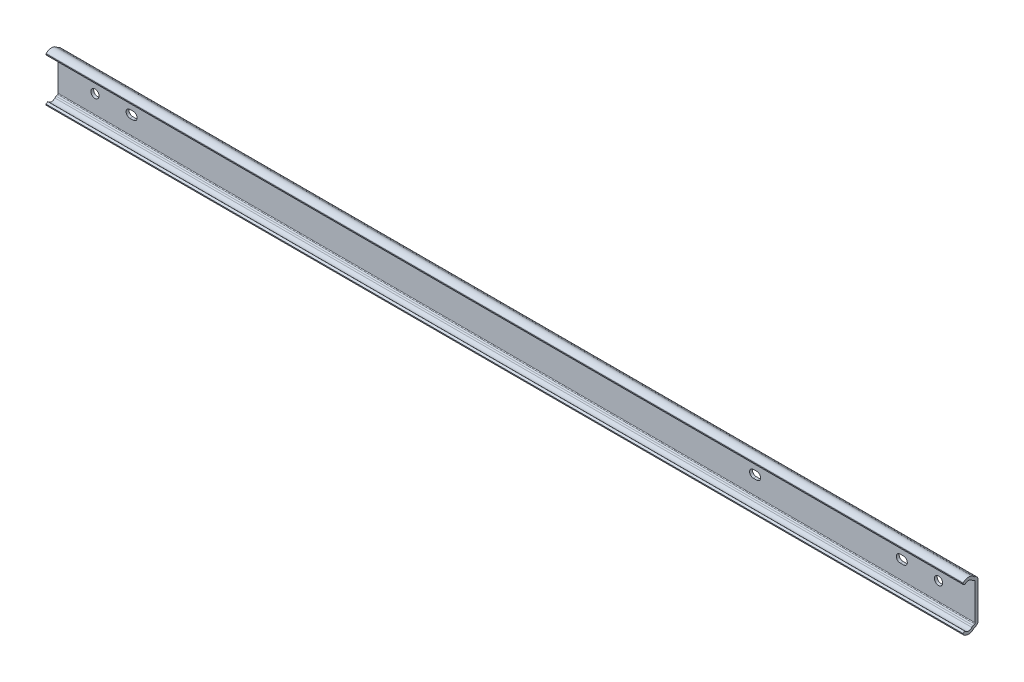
ISO-10303-21;
HEADER;
FILE_DESCRIPTION(('STEP AP214'),'2;1');
FILE_NAME('part.step','',(''),(''),'','','');
FILE_SCHEMA(('AUTOMOTIVE_DESIGN { 1 0 10303 214 1 1 1 1 }'));
ENDSEC;
DATA;
#1=APPLICATION_CONTEXT('core data for automotive mechanical design processes');
#2=APPLICATION_PROTOCOL_DEFINITION('international standard','automotive_design',2000,#1);
#3=PRODUCT_CONTEXT('',#1,'mechanical');
#4=PRODUCT('Part','Part','',(#3));
#5=PRODUCT_RELATED_PRODUCT_CATEGORY('part','',(#4));
#6=PRODUCT_DEFINITION_FORMATION('','',#4);
#7=PRODUCT_DEFINITION_CONTEXT('part definition',#1,'design');
#8=PRODUCT_DEFINITION('design','',#6,#7);
#9=PRODUCT_DEFINITION_SHAPE('','',#8);
#10=(LENGTH_UNIT() NAMED_UNIT(*) SI_UNIT(.MILLI.,.METRE.));
#11=(NAMED_UNIT(*) PLANE_ANGLE_UNIT() SI_UNIT($,.RADIAN.));
#12=(NAMED_UNIT(*) SI_UNIT($,.STERADIAN.) SOLID_ANGLE_UNIT());
#13=UNCERTAINTY_MEASURE_WITH_UNIT(LENGTH_MEASURE(1.E-05),#10,'distance_accuracy_value','');
#14=(GEOMETRIC_REPRESENTATION_CONTEXT(3) GLOBAL_UNCERTAINTY_ASSIGNED_CONTEXT((#13)) GLOBAL_UNIT_ASSIGNED_CONTEXT((#10,
#11,#12)) REPRESENTATION_CONTEXT('',''));
#15=CARTESIAN_POINT('',(0.,0.,0.));
#16=DIRECTION('',(0.,0.,1.));
#17=DIRECTION('',(1.,0.,0.));
#18=AXIS2_PLACEMENT_3D('',#15,#16,#17);
#19=CARTESIAN_POINT('',(-20.,9.85313395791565,1.54999999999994));
#20=DIRECTION('',(0.,0.,1.));
#21=DIRECTION('',(-1.,0.,0.));
#22=AXIS2_PLACEMENT_3D('',#19,#20,#21);
#23=PLANE('',#22);
#24=DIRECTION('',(0.,-1.,0.));
#25=VECTOR('',#24,1.);
#26=CARTESIAN_POINT('',(-20.,9.85313395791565,1.54999999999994));
#27=LINE('',#26,#25);
#28=CARTESIAN_POINT('',(-20.,9.85313395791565,1.54999999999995));
#29=VERTEX_POINT('',#28);
#30=CARTESIAN_POINT('',(-20.,-9.85313395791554,1.54999999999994));
#31=VERTEX_POINT('',#30);
#32=EDGE_CURVE('E510',#29,#31,#27,.T.);
#33=ORIENTED_EDGE('',*,*,#32,.T.);
#34=DIRECTION('',(1.,0.,0.));
#35=VECTOR('',#34,1.);
#36=CARTESIAN_POINT('',(-20.,-9.85313395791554,1.54999999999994));
#37=LINE('',#36,#35);
#38=CARTESIAN_POINT('',(480.,-9.85313395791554,1.54999999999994));
#39=VERTEX_POINT('',#38);
#40=EDGE_CURVE('E524',#31,#39,#37,.T.);
#41=ORIENTED_EDGE('',*,*,#40,.T.);
#42=DIRECTION('',(0.,-1.,0.));
#43=VECTOR('',#42,1.);
#44=CARTESIAN_POINT('',(480.,9.85313395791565,1.54999999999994));
#45=LINE('',#44,#43);
#46=CARTESIAN_POINT('',(480.,9.85313395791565,1.54999999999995));
#47=VERTEX_POINT('',#46);
#48=EDGE_CURVE('E435',#47,#39,#45,.T.);
#49=ORIENTED_EDGE('',*,*,#48,.F.);
#50=DIRECTION('',(1.,0.,0.));
#51=VECTOR('',#50,1.);
#52=CARTESIAN_POINT('',(-20.,9.85313395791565,1.54999999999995));
#53=LINE('',#52,#51);
#54=EDGE_CURVE('E526',#29,#47,#53,.T.);
#55=ORIENTED_EDGE('',*,*,#54,.F.);
#56=EDGE_LOOP('',(#33,#41,#49,#55));
#57=FACE_BOUND('',#56,.T.);
#58=CARTESIAN_POINT('',(20.9,0.,1.54999999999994));
#59=DIRECTION('',(0.,0.,1.));
#60=DIRECTION('',(-1.,0.,0.));
#61=AXIS2_PLACEMENT_3D('',#58,#59,#60);
#62=CIRCLE('',#61,2.1);
#63=CARTESIAN_POINT('',(20.9,-2.1,1.54999999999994));
#64=VERTEX_POINT('',#63);
#65=CARTESIAN_POINT('',(20.9,2.1,1.54999999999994));
#66=VERTEX_POINT('',#65);
#67=EDGE_CURVE('E31',#64,#66,#62,.T.);
#68=ORIENTED_EDGE('',*,*,#67,.F.);
#69=DIRECTION('',(1.,0.,0.));
#70=VECTOR('',#69,1.);
#71=CARTESIAN_POINT('',(20.9,-2.1,1.54999999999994));
#72=LINE('',#71,#70);
#73=CARTESIAN_POINT('',(19.1,-2.1,1.54999999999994));
#74=VERTEX_POINT('',#73);
#75=EDGE_CURVE('E277',#74,#64,#72,.T.);
#76=ORIENTED_EDGE('',*,*,#75,.F.);
#77=CARTESIAN_POINT('',(19.1,0.,1.54999999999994));
#78=DIRECTION('',(0.,0.,1.));
#79=DIRECTION('',(-1.,0.,0.));
#80=AXIS2_PLACEMENT_3D('',#77,#78,#79);
#81=CIRCLE('',#80,2.1);
#82=CARTESIAN_POINT('',(19.1,2.1,1.54999999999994));
#83=VERTEX_POINT('',#82);
#84=EDGE_CURVE('E262',#83,#74,#81,.T.);
#85=ORIENTED_EDGE('',*,*,#84,.F.);
#86=DIRECTION('',(-1.,0.,0.));
#87=VECTOR('',#86,1.);
#88=CARTESIAN_POINT('',(20.9,2.1,1.54999999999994));
#89=LINE('',#88,#87);
#90=EDGE_CURVE('E271',#66,#83,#89,.T.);
#91=ORIENTED_EDGE('',*,*,#90,.F.);
#92=EDGE_LOOP('',(#68,#76,#85,#91));
#93=FACE_BOUND('',#92,.T.);
#94=CARTESIAN_POINT('',(360.9,0.,1.54999999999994));
#95=DIRECTION('',(0.,0.,1.));
#96=DIRECTION('',(-1.,0.,0.));
#97=AXIS2_PLACEMENT_3D('',#94,#95,#96);
#98=CIRCLE('',#97,2.1);
#99=CARTESIAN_POINT('',(360.9,-2.09999999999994,1.54999999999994));
#100=VERTEX_POINT('',#99);
#101=CARTESIAN_POINT('',(360.9,2.10000000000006,1.54999999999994));
#102=VERTEX_POINT('',#101);
#103=EDGE_CURVE('E293',#100,#102,#98,.T.);
#104=ORIENTED_EDGE('',*,*,#103,.F.);
#105=DIRECTION('',(1.,0.,0.));
#106=VECTOR('',#105,1.);
#107=CARTESIAN_POINT('',(360.9,-2.09999999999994,1.54999999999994));
#108=LINE('',#107,#106);
#109=CARTESIAN_POINT('',(359.1,-2.09999999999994,1.54999999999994));
#110=VERTEX_POINT('',#109);
#111=EDGE_CURVE('E303',#110,#100,#108,.T.);
#112=ORIENTED_EDGE('',*,*,#111,.F.);
#113=CARTESIAN_POINT('',(359.1,0.,1.54999999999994));
#114=DIRECTION('',(0.,0.,1.));
#115=DIRECTION('',(-1.,0.,0.));
#116=AXIS2_PLACEMENT_3D('',#113,#114,#115);
#117=CIRCLE('',#116,2.1);
#118=CARTESIAN_POINT('',(359.1,2.10000000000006,1.54999999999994));
#119=VERTEX_POINT('',#118);
#120=EDGE_CURVE('E300',#119,#110,#117,.T.);
#121=ORIENTED_EDGE('',*,*,#120,.F.);
#122=DIRECTION('',(-1.,0.,0.));
#123=VECTOR('',#122,1.);
#124=CARTESIAN_POINT('',(360.9,2.10000000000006,1.54999999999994));
#125=LINE('',#124,#123);
#126=EDGE_CURVE('E297',#102,#119,#125,.T.);
#127=ORIENTED_EDGE('',*,*,#126,.F.);
#128=EDGE_LOOP('',(#104,#112,#121,#127));
#129=FACE_BOUND('',#128,.T.);
#130=CARTESIAN_POINT('',(460.,0.,1.54999999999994));
#131=DIRECTION('',(0.,0.,1.));
#132=DIRECTION('',(-1.,0.,0.));
#133=AXIS2_PLACEMENT_3D('',#130,#131,#132);
#134=CIRCLE('',#133,2.24999999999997);
#135=CARTESIAN_POINT('',(457.75,0.,1.54999999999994));
#136=VERTEX_POINT('',#135);
#137=EDGE_CURVE('E321',#136,#136,#134,.T.);
#138=ORIENTED_EDGE('',*,*,#137,.F.);
#139=EDGE_LOOP('',(#138));
#140=FACE_BOUND('',#139,.T.);
#141=CARTESIAN_POINT('',(0.,0.,1.54999999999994));
#142=DIRECTION('',(0.,0.,1.));
#143=DIRECTION('',(-1.,0.,0.));
#144=AXIS2_PLACEMENT_3D('',#141,#142,#143);
#145=CIRCLE('',#144,2.24999999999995);
#146=CARTESIAN_POINT('',(-2.24999999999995,0.,1.54999999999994));
#147=VERTEX_POINT('',#146);
#148=EDGE_CURVE('E333',#147,#147,#145,.T.);
#149=ORIENTED_EDGE('',*,*,#148,.F.);
#150=EDGE_LOOP('',(#149));
#151=FACE_BOUND('',#150,.T.);
#152=CARTESIAN_POINT('',(439.1,0.,1.54999999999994));
#153=DIRECTION('',(0.,0.,1.));
#154=DIRECTION('',(-1.,0.,0.));
#155=AXIS2_PLACEMENT_3D('',#152,#153,#154);
#156=CIRCLE('',#155,2.1);
#157=CARTESIAN_POINT('',(439.1,2.10000000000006,1.54999999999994));
#158=VERTEX_POINT('',#157);
#159=CARTESIAN_POINT('',(439.1,-2.09999999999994,1.54999999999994));
#160=VERTEX_POINT('',#159);
#161=EDGE_CURVE('E339',#158,#160,#156,.T.);
#162=ORIENTED_EDGE('',*,*,#161,.F.);
#163=DIRECTION('',(-1.,0.,0.));
#164=VECTOR('',#163,1.);
#165=CARTESIAN_POINT('',(440.9,2.10000000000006,1.54999999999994));
#166=LINE('',#165,#164);
#167=CARTESIAN_POINT('',(440.9,2.10000000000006,1.54999999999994));
#168=VERTEX_POINT('',#167);
#169=EDGE_CURVE('E347',#168,#158,#166,.T.);
#170=ORIENTED_EDGE('',*,*,#169,.F.);
#171=CARTESIAN_POINT('',(440.9,0.,1.54999999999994));
#172=DIRECTION('',(0.,0.,1.));
#173=DIRECTION('',(-1.,0.,0.));
#174=AXIS2_PLACEMENT_3D('',#171,#172,#173);
#175=CIRCLE('',#174,2.1);
#176=CARTESIAN_POINT('',(440.9,-2.09999999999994,1.54999999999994));
#177=VERTEX_POINT('',#176);
#178=EDGE_CURVE('E344',#177,#168,#175,.T.);
#179=ORIENTED_EDGE('',*,*,#178,.F.);
#180=DIRECTION('',(1.,0.,0.));
#181=VECTOR('',#180,1.);
#182=CARTESIAN_POINT('',(440.9,-2.09999999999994,1.54999999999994));
#183=LINE('',#182,#181);
#184=EDGE_CURVE('E341',#160,#177,#183,.T.);
#185=ORIENTED_EDGE('',*,*,#184,.F.);
#186=EDGE_LOOP('',(#162,#170,#179,#185));
#187=FACE_BOUND('',#186,.T.);
#188=ADVANCED_FACE('F14',(#57,#93,#129,#140,#151,#187),#23,.T.);
#189=CARTESIAN_POINT('',(-20.,9.85313395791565,0.));
#190=DIRECTION('',(0.,0.,-1.));
#191=DIRECTION('',(1.,0.,0.));
#192=AXIS2_PLACEMENT_3D('',#189,#190,#191);
#193=PLANE('',#192);
#194=DIRECTION('',(0.,1.,0.));
#195=VECTOR('',#194,1.);
#196=CARTESIAN_POINT('',(-20.,9.85313395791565,0.));
#197=LINE('',#196,#195);
#198=CARTESIAN_POINT('',(-20.,-9.85313395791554,0.));
#199=VERTEX_POINT('',#198);
#200=CARTESIAN_POINT('',(-20.,9.85313395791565,0.));
#201=VERTEX_POINT('',#200);
#202=EDGE_CURVE('E473',#199,#201,#197,.T.);
#203=ORIENTED_EDGE('',*,*,#202,.T.);
#204=DIRECTION('',(1.,0.,0.));
#205=VECTOR('',#204,1.);
#206=CARTESIAN_POINT('',(-20.,9.85313395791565,0.));
#207=LINE('',#206,#205);
#208=CARTESIAN_POINT('',(480.,9.85313395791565,0.));
#209=VERTEX_POINT('',#208);
#210=EDGE_CURVE('E551',#201,#209,#207,.T.);
#211=ORIENTED_EDGE('',*,*,#210,.T.);
#212=DIRECTION('',(0.,1.,0.));
#213=VECTOR('',#212,1.);
#214=CARTESIAN_POINT('',(480.,9.85313395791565,0.));
#215=LINE('',#214,#213);
#216=CARTESIAN_POINT('',(480.,-9.85313395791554,0.));
#217=VERTEX_POINT('',#216);
#218=EDGE_CURVE('E397',#217,#209,#215,.T.);
#219=ORIENTED_EDGE('',*,*,#218,.F.);
#220=DIRECTION('',(1.,0.,0.));
#221=VECTOR('',#220,1.);
#222=CARTESIAN_POINT('',(-20.,-9.85313395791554,0.));
#223=LINE('',#222,#221);
#224=EDGE_CURVE('E553',#199,#217,#223,.T.);
#225=ORIENTED_EDGE('',*,*,#224,.F.);
#226=EDGE_LOOP('',(#203,#211,#219,#225));
#227=FACE_BOUND('',#226,.T.);
#228=CARTESIAN_POINT('',(20.9,0.,0.));
#229=DIRECTION('',(0.,0.,1.));
#230=DIRECTION('',(-1.,0.,0.));
#231=AXIS2_PLACEMENT_3D('',#228,#229,#230);
#232=CIRCLE('',#231,2.1);
#233=CARTESIAN_POINT('',(20.9,-2.1,0.));
#234=VERTEX_POINT('',#233);
#235=CARTESIAN_POINT('',(20.9,2.1,0.));
#236=VERTEX_POINT('',#235);
#237=EDGE_CURVE('E279',#234,#236,#232,.T.);
#238=ORIENTED_EDGE('',*,*,#237,.T.);
#239=DIRECTION('',(-1.,0.,0.));
#240=VECTOR('',#239,1.);
#241=CARTESIAN_POINT('',(20.9,2.1,0.));
#242=LINE('',#241,#240);
#243=CARTESIAN_POINT('',(19.1,2.1,0.));
#244=VERTEX_POINT('',#243);
#245=EDGE_CURVE('E285',#236,#244,#242,.T.);
#246=ORIENTED_EDGE('',*,*,#245,.T.);
#247=CARTESIAN_POINT('',(19.1,0.,0.));
#248=DIRECTION('',(0.,0.,1.));
#249=DIRECTION('',(-1.,0.,0.));
#250=AXIS2_PLACEMENT_3D('',#247,#248,#249);
#251=CIRCLE('',#250,2.1);
#252=CARTESIAN_POINT('',(19.1,-2.1,0.));
#253=VERTEX_POINT('',#252);
#254=EDGE_CURVE('E39',#244,#253,#251,.T.);
#255=ORIENTED_EDGE('',*,*,#254,.T.);
#256=DIRECTION('',(1.,0.,0.));
#257=VECTOR('',#256,1.);
#258=CARTESIAN_POINT('',(20.9,-2.1,0.));
#259=LINE('',#258,#257);
#260=EDGE_CURVE('E288',#253,#234,#259,.T.);
#261=ORIENTED_EDGE('',*,*,#260,.T.);
#262=EDGE_LOOP('',(#238,#246,#255,#261));
#263=FACE_BOUND('',#262,.T.);
#264=CARTESIAN_POINT('',(360.9,0.,0.));
#265=DIRECTION('',(0.,0.,1.));
#266=DIRECTION('',(-1.,0.,0.));
#267=AXIS2_PLACEMENT_3D('',#264,#265,#266);
#268=CIRCLE('',#267,2.1);
#269=CARTESIAN_POINT('',(360.9,-2.09999999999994,0.));
#270=VERTEX_POINT('',#269);
#271=CARTESIAN_POINT('',(360.9,2.10000000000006,0.));
#272=VERTEX_POINT('',#271);
#273=EDGE_CURVE('E306',#270,#272,#268,.T.);
#274=ORIENTED_EDGE('',*,*,#273,.T.);
#275=DIRECTION('',(-1.,0.,0.));
#276=VECTOR('',#275,1.);
#277=CARTESIAN_POINT('',(360.9,2.10000000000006,0.));
#278=LINE('',#277,#276);
#279=CARTESIAN_POINT('',(359.1,2.10000000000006,0.));
#280=VERTEX_POINT('',#279);
#281=EDGE_CURVE('E309',#272,#280,#278,.T.);
#282=ORIENTED_EDGE('',*,*,#281,.T.);
#283=CARTESIAN_POINT('',(359.1,0.,0.));
#284=DIRECTION('',(0.,0.,1.));
#285=DIRECTION('',(-1.,0.,0.));
#286=AXIS2_PLACEMENT_3D('',#283,#284,#285);
#287=CIRCLE('',#286,2.1);
#288=CARTESIAN_POINT('',(359.1,-2.09999999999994,0.));
#289=VERTEX_POINT('',#288);
#290=EDGE_CURVE('E312',#280,#289,#287,.T.);
#291=ORIENTED_EDGE('',*,*,#290,.T.);
#292=DIRECTION('',(1.,0.,0.));
#293=VECTOR('',#292,1.);
#294=CARTESIAN_POINT('',(360.9,-2.09999999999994,0.));
#295=LINE('',#294,#293);
#296=EDGE_CURVE('E315',#289,#270,#295,.T.);
#297=ORIENTED_EDGE('',*,*,#296,.T.);
#298=EDGE_LOOP('',(#274,#282,#291,#297));
#299=FACE_BOUND('',#298,.T.);
#300=CARTESIAN_POINT('',(460.,0.,0.));
#301=DIRECTION('',(0.,0.,1.));
#302=DIRECTION('',(-1.,0.,0.));
#303=AXIS2_PLACEMENT_3D('',#300,#301,#302);
#304=CIRCLE('',#303,2.24999999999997);
#305=CARTESIAN_POINT('',(457.75,0.,0.));
#306=VERTEX_POINT('',#305);
#307=EDGE_CURVE('E330',#306,#306,#304,.T.);
#308=ORIENTED_EDGE('',*,*,#307,.T.);
#309=EDGE_LOOP('',(#308));
#310=FACE_BOUND('',#309,.T.);
#311=CARTESIAN_POINT('',(0.,0.,0.));
#312=DIRECTION('',(0.,0.,1.));
#313=DIRECTION('',(-1.,0.,0.));
#314=AXIS2_PLACEMENT_3D('',#311,#312,#313);
#315=CIRCLE('',#314,2.24999999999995);
#316=CARTESIAN_POINT('',(-2.24999999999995,0.,0.));
#317=VERTEX_POINT('',#316);
#318=EDGE_CURVE('E336',#317,#317,#315,.T.);
#319=ORIENTED_EDGE('',*,*,#318,.T.);
#320=EDGE_LOOP('',(#319));
#321=FACE_BOUND('',#320,.T.);
#322=CARTESIAN_POINT('',(439.1,0.,0.));
#323=DIRECTION('',(0.,0.,1.));
#324=DIRECTION('',(-1.,0.,0.));
#325=AXIS2_PLACEMENT_3D('',#322,#323,#324);
#326=CIRCLE('',#325,2.1);
#327=CARTESIAN_POINT('',(439.1,2.10000000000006,0.));
#328=VERTEX_POINT('',#327);
#329=CARTESIAN_POINT('',(439.1,-2.09999999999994,0.));
#330=VERTEX_POINT('',#329);
#331=EDGE_CURVE('E350',#328,#330,#326,.T.);
#332=ORIENTED_EDGE('',*,*,#331,.T.);
#333=DIRECTION('',(1.,0.,0.));
#334=VECTOR('',#333,1.);
#335=CARTESIAN_POINT('',(440.9,-2.09999999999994,0.));
#336=LINE('',#335,#334);
#337=CARTESIAN_POINT('',(440.9,-2.09999999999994,0.));
#338=VERTEX_POINT('',#337);
#339=EDGE_CURVE('E353',#330,#338,#336,.T.);
#340=ORIENTED_EDGE('',*,*,#339,.T.);
#341=CARTESIAN_POINT('',(440.9,0.,0.));
#342=DIRECTION('',(0.,0.,1.));
#343=DIRECTION('',(-1.,0.,0.));
#344=AXIS2_PLACEMENT_3D('',#341,#342,#343);
#345=CIRCLE('',#344,2.1);
#346=CARTESIAN_POINT('',(440.9,2.10000000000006,0.));
#347=VERTEX_POINT('',#346);
#348=EDGE_CURVE('E356',#338,#347,#345,.T.);
#349=ORIENTED_EDGE('',*,*,#348,.T.);
#350=DIRECTION('',(-1.,0.,0.));
#351=VECTOR('',#350,1.);
#352=CARTESIAN_POINT('',(440.9,2.10000000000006,0.));
#353=LINE('',#352,#351);
#354=EDGE_CURVE('E359',#347,#328,#353,.T.);
#355=ORIENTED_EDGE('',*,*,#354,.T.);
#356=EDGE_LOOP('',(#332,#340,#349,#355));
#357=FACE_BOUND('',#356,.T.);
#358=ADVANCED_FACE('F618',(#227,#263,#299,#310,#321,#357),#193,.T.);
#359=CARTESIAN_POINT('',(-20.,-9.46999976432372,5.19000022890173));
#360=DIRECTION('',(1.,0.,0.));
#361=DIRECTION('',(0.,0.,1.));
#362=AXIS2_PLACEMENT_3D('',#359,#360,#361);
#363=CYLINDRICAL_SURFACE('',#362,2.47999999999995);
#364=CARTESIAN_POINT('',(480.,-9.46999976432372,5.19000022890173));
#365=DIRECTION('',(-1.,0.,0.));
#366=DIRECTION('',(0.,0.,1.));
#367=AXIS2_PLACEMENT_3D('',#364,#365,#366);
#368=CIRCLE('',#367,2.47999999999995);
#369=CARTESIAN_POINT('',(480.,-11.1527317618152,3.3682392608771));
#370=VERTEX_POINT('',#369);
#371=CARTESIAN_POINT('',(480.,-11.2236245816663,6.94362504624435));
#372=VERTEX_POINT('',#371);
#373=EDGE_CURVE('E365',#370,#372,#368,.T.);
#374=ORIENTED_EDGE('',*,*,#373,.F.);
#375=DIRECTION('',(1.,0.,0.));
#376=VECTOR('',#375,1.);
#377=CARTESIAN_POINT('',(-20.,-11.1527317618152,3.3682392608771));
#378=LINE('',#377,#376);
#379=CARTESIAN_POINT('',(-20.,-11.1527317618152,3.3682392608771));
#380=VERTEX_POINT('',#379);
#381=EDGE_CURVE('E9',#380,#370,#378,.T.);
#382=ORIENTED_EDGE('',*,*,#381,.F.);
#383=CARTESIAN_POINT('',(-20.,-9.46999976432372,5.19000022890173));
#384=DIRECTION('',(-1.,0.,0.));
#385=DIRECTION('',(0.,0.,1.));
#386=AXIS2_PLACEMENT_3D('',#383,#384,#385);
#387=CIRCLE('',#386,2.47999999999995);
#388=CARTESIAN_POINT('',(-20.,-11.2236245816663,6.94362504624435));
#389=VERTEX_POINT('',#388);
#390=EDGE_CURVE('E447',#380,#389,#387,.T.);
#391=ORIENTED_EDGE('',*,*,#390,.T.);
#392=DIRECTION('',(1.,0.,0.));
#393=VECTOR('',#392,1.);
#394=CARTESIAN_POINT('',(-20.,-11.2236245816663,6.94362504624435));
#395=LINE('',#394,#393);
#396=EDGE_CURVE('E18',#389,#372,#395,.T.);
#397=ORIENTED_EDGE('',*,*,#396,.T.);
#398=EDGE_LOOP('',(#374,#382,#391,#397));
#399=FACE_BOUND('',#398,.T.);
#400=ADVANCED_FACE('F16',(#399),#363,.F.);
#401=CARTESIAN_POINT('',(-20.,-12.5436997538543,1.86234824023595));
#402=DIRECTION('',(1.,0.,0.));
#403=DIRECTION('',(0.,0.,1.));
#404=AXIS2_PLACEMENT_3D('',#401,#402,#403);
#405=CYLINDRICAL_SURFACE('',#404,2.04999993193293);
#406=CARTESIAN_POINT('',(480.,-12.5436997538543,1.86234824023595));
#407=DIRECTION('',(1.,0.,0.));
#408=DIRECTION('',(0.,0.,1.));
#409=AXIS2_PLACEMENT_3D('',#406,#407,#408);
#410=CIRCLE('',#409,2.04999993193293);
#411=CARTESIAN_POINT('',(480.,-10.6566648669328,2.66334702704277));
#412=VERTEX_POINT('',#411);
#413=EDGE_CURVE('E444',#412,#370,#410,.T.);
#414=ORIENTED_EDGE('',*,*,#413,.F.);
#415=DIRECTION('',(1.,0.,0.));
#416=VECTOR('',#415,1.);
#417=CARTESIAN_POINT('',(-20.,-10.6566648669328,2.66334702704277));
#418=LINE('',#417,#416);
#419=CARTESIAN_POINT('',(-20.,-10.6566648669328,2.66334702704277));
#420=VERTEX_POINT('',#419);
#421=EDGE_CURVE('E23',#420,#412,#418,.T.);
#422=ORIENTED_EDGE('',*,*,#421,.F.);
#423=CARTESIAN_POINT('',(-20.,-12.5436997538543,1.86234824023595));
#424=DIRECTION('',(1.,0.,0.));
#425=DIRECTION('',(0.,0.,1.));
#426=AXIS2_PLACEMENT_3D('',#423,#424,#425);
#427=CIRCLE('',#426,2.04999993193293);
#428=EDGE_CURVE('E518',#420,#380,#427,.T.);
#429=ORIENTED_EDGE('',*,*,#428,.T.);
#430=ORIENTED_EDGE('',*,*,#381,.T.);
#431=EDGE_LOOP('',(#414,#422,#429,#430));
#432=FACE_BOUND('',#431,.T.);
#433=ADVANCED_FACE('F581',(#432),#405,.T.);
#434=CARTESIAN_POINT('',(-20.,-10.6566648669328,2.66334702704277));
#435=DIRECTION('',(0.,0.920504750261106,0.390731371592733));
#436=DIRECTION('',(0.,-0.390731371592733,0.920504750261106));
#437=AXIS2_PLACEMENT_3D('',#434,#435,#436);
#438=PLANE('',#437);
#439=DIRECTION('',(0.,-0.390731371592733,0.920504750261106));
#440=VECTOR('',#439,1.);
#441=CARTESIAN_POINT('',(480.,-10.6566648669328,2.66334702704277));
#442=LINE('',#441,#440);
#443=CARTESIAN_POINT('',(480.,-10.3133868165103,1.85463521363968));
#444=VERTEX_POINT('',#443);
#445=EDGE_CURVE('E441',#444,#412,#442,.T.);
#446=ORIENTED_EDGE('',*,*,#445,.F.);
#447=DIRECTION('',(1.,0.,0.));
#448=VECTOR('',#447,1.);
#449=CARTESIAN_POINT('',(-20.,-10.3133868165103,1.85463521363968));
#450=LINE('',#449,#448);
#451=CARTESIAN_POINT('',(-20.,-10.3133868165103,1.85463521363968));
#452=VERTEX_POINT('',#451);
#453=EDGE_CURVE('E522',#452,#444,#450,.T.);
#454=ORIENTED_EDGE('',*,*,#453,.F.);
#455=DIRECTION('',(0.,-0.390731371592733,0.920504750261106));
#456=VECTOR('',#455,1.);
#457=CARTESIAN_POINT('',(-20.,-10.6566648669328,2.66334702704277));
#458=LINE('',#457,#456);
#459=EDGE_CURVE('E515',#452,#420,#458,.T.);
#460=ORIENTED_EDGE('',*,*,#459,.T.);
#461=ORIENTED_EDGE('',*,*,#421,.T.);
#462=EDGE_LOOP('',(#446,#454,#460,#461));
#463=FACE_BOUND('',#462,.T.);
#464=ADVANCED_FACE('F678',(#463),#438,.T.);
#465=CARTESIAN_POINT('',(-20.,-9.85313395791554,2.05000015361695));
#466=DIRECTION('',(1.,0.,0.));
#467=DIRECTION('',(0.,0.,1.));
#468=AXIS2_PLACEMENT_3D('',#465,#466,#467);
#469=CYLINDRICAL_SURFACE('',#468,0.500000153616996);
#470=CARTESIAN_POINT('',(480.,-9.85313395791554,2.05000015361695));
#471=DIRECTION('',(-1.,0.,0.));
#472=DIRECTION('',(0.,0.,1.));
#473=AXIS2_PLACEMENT_3D('',#470,#471,#472);
#474=CIRCLE('',#473,0.500000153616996);
#475=EDGE_CURVE('E438',#39,#444,#474,.T.);
#476=ORIENTED_EDGE('',*,*,#475,.F.);
#477=ORIENTED_EDGE('',*,*,#40,.F.);
#478=CARTESIAN_POINT('',(-20.,-9.85313395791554,2.05000015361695));
#479=DIRECTION('',(-1.,0.,0.));
#480=DIRECTION('',(0.,0.,1.));
#481=AXIS2_PLACEMENT_3D('',#478,#479,#480);
#482=CIRCLE('',#481,0.500000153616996);
#483=EDGE_CURVE('E512',#31,#452,#482,.T.);
#484=ORIENTED_EDGE('',*,*,#483,.T.);
#485=ORIENTED_EDGE('',*,*,#453,.T.);
#486=EDGE_LOOP('',(#476,#477,#484,#485));
#487=FACE_BOUND('',#486,.T.);
#488=ADVANCED_FACE('F676',(#487),#469,.F.);
#489=CARTESIAN_POINT('',(-20.,9.85313395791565,2.05000015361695));
#490=DIRECTION('',(1.,0.,0.));
#491=DIRECTION('',(0.,0.,1.));
#492=AXIS2_PLACEMENT_3D('',#489,#490,#491);
#493=CYLINDRICAL_SURFACE('',#492,0.500000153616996);
#494=CARTESIAN_POINT('',(480.,9.85313395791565,2.05000015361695));
#495=DIRECTION('',(-1.,0.,0.));
#496=DIRECTION('',(0.,0.,-1.));
#497=AXIS2_PLACEMENT_3D('',#494,#495,#496);
#498=CIRCLE('',#497,0.500000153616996);
#499=CARTESIAN_POINT('',(480.,10.3133868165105,1.85463521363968));
#500=VERTEX_POINT('',#499);
#501=EDGE_CURVE('E432',#500,#47,#498,.T.);
#502=ORIENTED_EDGE('',*,*,#501,.F.);
#503=DIRECTION('',(1.,0.,0.));
#504=VECTOR('',#503,1.);
#505=CARTESIAN_POINT('',(-20.,10.3133868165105,1.85463521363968));
#506=LINE('',#505,#504);
#507=CARTESIAN_POINT('',(-20.,10.3133868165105,1.85463521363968));
#508=VERTEX_POINT('',#507);
#509=EDGE_CURVE('E528',#508,#500,#506,.T.);
#510=ORIENTED_EDGE('',*,*,#509,.F.);
#511=CARTESIAN_POINT('',(-20.,9.85313395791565,2.05000015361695));
#512=DIRECTION('',(-1.,0.,0.));
#513=DIRECTION('',(0.,0.,-1.));
#514=AXIS2_PLACEMENT_3D('',#511,#512,#513);
#515=CIRCLE('',#514,0.500000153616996);
#516=EDGE_CURVE('E507',#508,#29,#515,.T.);
#517=ORIENTED_EDGE('',*,*,#516,.T.);
#518=ORIENTED_EDGE('',*,*,#54,.T.);
#519=EDGE_LOOP('',(#502,#510,#517,#518));
#520=FACE_BOUND('',#519,.T.);
#521=ADVANCED_FACE('F668',(#520),#493,.F.);
#522=CARTESIAN_POINT('',(-20.,10.6566648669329,2.66334702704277));
#523=DIRECTION('',(0.,-0.920504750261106,0.390731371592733));
#524=DIRECTION('',(0.,-0.390731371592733,-0.920504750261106));
#525=AXIS2_PLACEMENT_3D('',#522,#523,#524);
#526=PLANE('',#525);
#527=DIRECTION('',(0.,-0.390731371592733,-0.920504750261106));
#528=VECTOR('',#527,1.);
#529=CARTESIAN_POINT('',(480.,10.6566648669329,2.66334702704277));
#530=LINE('',#529,#528);
#531=CARTESIAN_POINT('',(480.,10.6566648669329,2.66334702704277));
#532=VERTEX_POINT('',#531);
#533=EDGE_CURVE('E429',#532,#500,#530,.T.);
#534=ORIENTED_EDGE('',*,*,#533,.F.);
#535=DIRECTION('',(1.,0.,0.));
#536=VECTOR('',#535,1.);
#537=CARTESIAN_POINT('',(-20.,10.6566648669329,2.66334702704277));
#538=LINE('',#537,#536);
#539=CARTESIAN_POINT('',(-20.,10.6566648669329,2.66334702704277));
#540=VERTEX_POINT('',#539);
#541=EDGE_CURVE('E530',#540,#532,#538,.T.);
#542=ORIENTED_EDGE('',*,*,#541,.F.);
#543=DIRECTION('',(0.,-0.390731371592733,-0.920504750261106));
#544=VECTOR('',#543,1.);
#545=CARTESIAN_POINT('',(-20.,10.6566648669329,2.66334702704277));
#546=LINE('',#545,#544);
#547=EDGE_CURVE('E504',#540,#508,#546,.T.);
#548=ORIENTED_EDGE('',*,*,#547,.T.);
#549=ORIENTED_EDGE('',*,*,#509,.T.);
#550=EDGE_LOOP('',(#534,#542,#548,#549));
#551=FACE_BOUND('',#550,.T.);
#552=ADVANCED_FACE('F664',(#551),#526,.T.);
#553=CARTESIAN_POINT('',(-20.,12.5436997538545,1.86234824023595));
#554=DIRECTION('',(1.,0.,0.));
#555=DIRECTION('',(0.,0.,1.));
#556=AXIS2_PLACEMENT_3D('',#553,#554,#555);
#557=CYLINDRICAL_SURFACE('',#556,2.04999993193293);
#558=CARTESIAN_POINT('',(480.,12.5436997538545,1.86234824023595));
#559=DIRECTION('',(1.,0.,0.));
#560=DIRECTION('',(0.,0.,-1.));
#561=AXIS2_PLACEMENT_3D('',#558,#559,#560);
#562=CIRCLE('',#561,2.04999993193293);
#563=CARTESIAN_POINT('',(480.,11.1527317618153,3.36823926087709));
#564=VERTEX_POINT('',#563);
#565=EDGE_CURVE('E426',#564,#532,#562,.T.);
#566=ORIENTED_EDGE('',*,*,#565,.F.);
#567=DIRECTION('',(1.,0.,0.));
#568=VECTOR('',#567,1.);
#569=CARTESIAN_POINT('',(-20.,11.1527317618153,3.36823926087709));
#570=LINE('',#569,#568);
#571=CARTESIAN_POINT('',(-20.,11.1527317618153,3.36823926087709));
#572=VERTEX_POINT('',#571);
#573=EDGE_CURVE('E532',#572,#564,#570,.T.);
#574=ORIENTED_EDGE('',*,*,#573,.F.);
#575=CARTESIAN_POINT('',(-20.,12.5436997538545,1.86234824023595));
#576=DIRECTION('',(1.,0.,0.));
#577=DIRECTION('',(0.,0.,-1.));
#578=AXIS2_PLACEMENT_3D('',#575,#576,#577);
#579=CIRCLE('',#578,2.04999993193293);
#580=EDGE_CURVE('E501',#572,#540,#579,.T.);
#581=ORIENTED_EDGE('',*,*,#580,.T.);
#582=ORIENTED_EDGE('',*,*,#541,.T.);
#583=EDGE_LOOP('',(#566,#574,#581,#582));
#584=FACE_BOUND('',#583,.T.);
#585=ADVANCED_FACE('F660',(#584),#557,.T.);
#586=CARTESIAN_POINT('',(-20.,9.46999976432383,5.19000022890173));
#587=DIRECTION('',(1.,0.,0.));
#588=DIRECTION('',(0.,0.,1.));
#589=AXIS2_PLACEMENT_3D('',#586,#587,#588);
#590=CYLINDRICAL_SURFACE('',#589,2.47999999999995);
#591=CARTESIAN_POINT('',(480.,9.46999976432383,5.19000022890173));
#592=DIRECTION('',(-1.,0.,0.));
#593=DIRECTION('',(0.,0.,-1.));
#594=AXIS2_PLACEMENT_3D('',#591,#592,#593);
#595=CIRCLE('',#594,2.47999999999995);
#596=CARTESIAN_POINT('',(480.,11.2236245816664,6.94362504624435));
#597=VERTEX_POINT('',#596);
#598=EDGE_CURVE('E423',#597,#564,#595,.T.);
#599=ORIENTED_EDGE('',*,*,#598,.F.);
#600=DIRECTION('',(1.,0.,0.));
#601=VECTOR('',#600,1.);
#602=CARTESIAN_POINT('',(-20.,11.2236245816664,6.94362504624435));
#603=LINE('',#602,#601);
#604=CARTESIAN_POINT('',(-20.,11.2236245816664,6.94362504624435));
#605=VERTEX_POINT('',#604);
#606=EDGE_CURVE('E534',#605,#597,#603,.T.);
#607=ORIENTED_EDGE('',*,*,#606,.F.);
#608=CARTESIAN_POINT('',(-20.,9.46999976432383,5.19000022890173));
#609=DIRECTION('',(-1.,0.,0.));
#610=DIRECTION('',(0.,0.,-1.));
#611=AXIS2_PLACEMENT_3D('',#608,#609,#610);
#612=CIRCLE('',#611,2.47999999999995);
#613=EDGE_CURVE('E498',#605,#572,#612,.T.);
#614=ORIENTED_EDGE('',*,*,#613,.T.);
#615=ORIENTED_EDGE('',*,*,#573,.T.);
#616=EDGE_LOOP('',(#599,#607,#614,#615));
#617=FACE_BOUND('',#616,.T.);
#618=ADVANCED_FACE('F656',(#617),#590,.F.);
#619=CARTESIAN_POINT('',(-20.,11.2236245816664,6.94362504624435));
#620=DIRECTION('',(0.,-0.707107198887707,-0.707106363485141));
#621=DIRECTION('',(0.,0.707106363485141,-0.707107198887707));
#622=AXIS2_PLACEMENT_3D('',#619,#620,#621);
#623=PLANE('',#622);
#624=DIRECTION('',(0.,0.707106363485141,-0.707107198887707));
#625=VECTOR('',#624,1.);
#626=CARTESIAN_POINT('',(480.,11.2236245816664,6.94362504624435));
#627=LINE('',#626,#625);
#628=CARTESIAN_POINT('',(480.,10.9144127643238,7.25283722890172));
#629=VERTEX_POINT('',#628);
#630=EDGE_CURVE('E420',#629,#597,#627,.T.);
#631=ORIENTED_EDGE('',*,*,#630,.F.);
#632=DIRECTION('',(1.,0.,0.));
#633=VECTOR('',#632,1.);
#634=CARTESIAN_POINT('',(-20.,10.9144127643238,7.25283722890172));
#635=LINE('',#634,#633);
#636=CARTESIAN_POINT('',(-20.,10.9144127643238,7.25283722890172));
#637=VERTEX_POINT('',#636);
#638=EDGE_CURVE('E536',#637,#629,#635,.T.);
#639=ORIENTED_EDGE('',*,*,#638,.F.);
#640=DIRECTION('',(0.,0.707106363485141,-0.707107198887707));
#641=VECTOR('',#640,1.);
#642=CARTESIAN_POINT('',(-20.,11.2236245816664,6.94362504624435));
#643=LINE('',#642,#641);
#644=EDGE_CURVE('E495',#637,#605,#643,.T.);
#645=ORIENTED_EDGE('',*,*,#644,.T.);
#646=ORIENTED_EDGE('',*,*,#606,.T.);
#647=EDGE_LOOP('',(#631,#639,#645,#646));
#648=FACE_BOUND('',#647,.T.);
#649=ADVANCED_FACE('F652',(#648),#623,.T.);
#650=CARTESIAN_POINT('',(-20.,10.9144127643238,7.25283722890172));
#651=DIRECTION('',(0.,-0.819151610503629,0.573577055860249));
#652=DIRECTION('',(0.,-0.573577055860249,-0.819151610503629));
#653=AXIS2_PLACEMENT_3D('',#650,#651,#652);
#654=PLANE('',#653);
#655=DIRECTION('',(0.,-0.573577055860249,-0.819151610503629));
#656=VECTOR('',#655,1.);
#657=CARTESIAN_POINT('',(480.,10.9144127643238,7.25283722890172));
#658=LINE('',#657,#656);
#659=CARTESIAN_POINT('',(480.,11.5986307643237,8.23000022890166));
#660=VERTEX_POINT('',#659);
#661=EDGE_CURVE('E417',#660,#629,#658,.T.);
#662=ORIENTED_EDGE('',*,*,#661,.F.);
#663=DIRECTION('',(1.,0.,0.));
#664=VECTOR('',#663,1.);
#665=CARTESIAN_POINT('',(-20.,11.5986307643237,8.23000022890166));
#666=LINE('',#665,#664);
#667=CARTESIAN_POINT('',(-20.,11.5986307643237,8.23000022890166));
#668=VERTEX_POINT('',#667);
#669=EDGE_CURVE('E538',#668,#660,#666,.T.);
#670=ORIENTED_EDGE('',*,*,#669,.F.);
#671=DIRECTION('',(0.,-0.573577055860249,-0.819151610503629));
#672=VECTOR('',#671,1.);
#673=CARTESIAN_POINT('',(-20.,10.9144127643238,7.25283722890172));
#674=LINE('',#673,#672);
#675=EDGE_CURVE('E492',#668,#637,#674,.T.);
#676=ORIENTED_EDGE('',*,*,#675,.T.);
#677=ORIENTED_EDGE('',*,*,#638,.T.);
#678=EDGE_LOOP('',(#662,#670,#676,#677));
#679=FACE_BOUND('',#678,.T.);
#680=ADVANCED_FACE('F648',(#679),#654,.T.);
#681=CARTESIAN_POINT('',(-20.,12.1292794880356,8.22999995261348));
#682=DIRECTION('',(0.,5.20661172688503E-07,0.999999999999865));
#683=DIRECTION('',(0.,-0.999999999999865,5.20661172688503E-07));
#684=AXIS2_PLACEMENT_3D('',#681,#682,#683);
#685=PLANE('',#684);
#686=DIRECTION('',(0.,-0.999999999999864,5.20661172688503E-07));
#687=VECTOR('',#686,1.);
#688=CARTESIAN_POINT('',(480.,12.1292794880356,8.22999995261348));
#689=LINE('',#688,#687);
#690=CARTESIAN_POINT('',(480.,12.1292794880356,8.22999995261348));
#691=VERTEX_POINT('',#690);
#692=EDGE_CURVE('E414',#691,#660,#689,.T.);
#693=ORIENTED_EDGE('',*,*,#692,.F.);
#694=DIRECTION('',(1.,0.,0.));
#695=VECTOR('',#694,1.);
#696=CARTESIAN_POINT('',(-20.,12.1292794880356,8.22999995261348));
#697=LINE('',#696,#695);
#698=CARTESIAN_POINT('',(-20.,12.1292794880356,8.22999995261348));
#699=VERTEX_POINT('',#698);
#700=EDGE_CURVE('E540',#699,#691,#697,.T.);
#701=ORIENTED_EDGE('',*,*,#700,.F.);
#702=DIRECTION('',(0.,-0.999999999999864,5.20661172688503E-07));
#703=VECTOR('',#702,1.);
#704=CARTESIAN_POINT('',(-20.,12.1292794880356,8.22999995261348));
#705=LINE('',#704,#703);
#706=EDGE_CURVE('E489',#699,#668,#705,.T.);
#707=ORIENTED_EDGE('',*,*,#706,.T.);
#708=ORIENTED_EDGE('',*,*,#669,.T.);
#709=EDGE_LOOP('',(#693,#701,#707,#708));
#710=FACE_BOUND('',#709,.T.);
#711=ADVANCED_FACE('F644',(#710),#685,.T.);
#712=CARTESIAN_POINT('',(-20.,12.3196398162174,8.03964028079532));
#713=DIRECTION('',(0.,0.70710556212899,0.707108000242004));
#714=DIRECTION('',(0.,-0.707108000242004,0.70710556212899));
#715=AXIS2_PLACEMENT_3D('',#712,#713,#714);
#716=PLANE('',#715);
#717=DIRECTION('',(0.,-0.707108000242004,0.70710556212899));
#718=VECTOR('',#717,1.);
#719=CARTESIAN_POINT('',(480.,12.3196398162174,8.03964028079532));
#720=LINE('',#719,#718);
#721=CARTESIAN_POINT('',(480.,12.3196398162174,8.03964028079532));
#722=VERTEX_POINT('',#721);
#723=EDGE_CURVE('E411',#722,#691,#720,.T.);
#724=ORIENTED_EDGE('',*,*,#723,.F.);
#725=DIRECTION('',(1.,0.,0.));
#726=VECTOR('',#725,1.);
#727=CARTESIAN_POINT('',(-20.,12.3196398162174,8.03964028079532));
#728=LINE('',#727,#726);
#729=CARTESIAN_POINT('',(-20.,12.3196398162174,8.03964028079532));
#730=VERTEX_POINT('',#729);
#731=EDGE_CURVE('E542',#730,#722,#728,.T.);
#732=ORIENTED_EDGE('',*,*,#731,.F.);
#733=DIRECTION('',(0.,-0.707108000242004,0.70710556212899));
#734=VECTOR('',#733,1.);
#735=CARTESIAN_POINT('',(-20.,12.3196398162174,8.03964028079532));
#736=LINE('',#735,#734);
#737=EDGE_CURVE('E486',#730,#699,#736,.T.);
#738=ORIENTED_EDGE('',*,*,#737,.T.);
#739=ORIENTED_EDGE('',*,*,#700,.T.);
#740=EDGE_LOOP('',(#724,#732,#738,#739));
#741=FACE_BOUND('',#740,.T.);
#742=ADVANCED_FACE('F640',(#741),#716,.T.);
#743=CARTESIAN_POINT('',(-20.,9.46999976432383,5.19000022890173));
#744=DIRECTION('',(1.,0.,0.));
#745=DIRECTION('',(0.,0.,1.));
#746=AXIS2_PLACEMENT_3D('',#743,#744,#745);
#747=CYLINDRICAL_SURFACE('',#746,4.02999960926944);
#748=CARTESIAN_POINT('',(480.,9.46999976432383,5.19000022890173));
#749=DIRECTION('',(1.,0.,0.));
#750=DIRECTION('',(0.,0.,-1.));
#751=AXIS2_PLACEMENT_3D('',#748,#749,#750);
#752=CIRCLE('',#751,4.02999960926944);
#753=CARTESIAN_POINT('',(480.,12.2044389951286,2.22963894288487));
#754=VERTEX_POINT('',#753);
#755=EDGE_CURVE('E408',#754,#722,#752,.T.);
#756=ORIENTED_EDGE('',*,*,#755,.F.);
#757=DIRECTION('',(1.,0.,0.));
#758=VECTOR('',#757,1.);
#759=CARTESIAN_POINT('',(-20.,12.2044389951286,2.22963894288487));
#760=LINE('',#759,#758);
#761=CARTESIAN_POINT('',(-20.,12.2044389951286,2.22963894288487));
#762=VERTEX_POINT('',#761);
#763=EDGE_CURVE('E544',#762,#754,#760,.T.);
#764=ORIENTED_EDGE('',*,*,#763,.F.);
#765=CARTESIAN_POINT('',(-20.,9.46999976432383,5.19000022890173));
#766=DIRECTION('',(1.,0.,0.));
#767=DIRECTION('',(0.,0.,-1.));
#768=AXIS2_PLACEMENT_3D('',#765,#766,#767);
#769=CIRCLE('',#768,4.02999960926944);
#770=EDGE_CURVE('E483',#762,#730,#769,.T.);
#771=ORIENTED_EDGE('',*,*,#770,.T.);
#772=ORIENTED_EDGE('',*,*,#731,.T.);
#773=EDGE_LOOP('',(#756,#764,#771,#772));
#774=FACE_BOUND('',#773,.T.);
#775=ADVANCED_FACE('F636',(#774),#747,.T.);
#776=CARTESIAN_POINT('',(-20.,12.5436997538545,1.86234824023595));
#777=DIRECTION('',(1.,0.,0.));
#778=DIRECTION('',(0.,0.,1.));
#779=AXIS2_PLACEMENT_3D('',#776,#777,#778);
#780=CYLINDRICAL_SURFACE('',#779,0.500000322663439);
#781=CARTESIAN_POINT('',(480.,12.5436997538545,1.86234824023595));
#782=DIRECTION('',(-1.,0.,0.));
#783=DIRECTION('',(0.,0.,-1.));
#784=AXIS2_PLACEMENT_3D('',#781,#782,#783);
#785=CIRCLE('',#784,0.500000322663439);
#786=CARTESIAN_POINT('',(480.,12.0834470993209,2.05771409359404));
#787=VERTEX_POINT('',#786);
#788=EDGE_CURVE('E405',#787,#754,#785,.T.);
#789=ORIENTED_EDGE('',*,*,#788,.F.);
#790=DIRECTION('',(1.,0.,0.));
#791=VECTOR('',#790,1.);
#792=CARTESIAN_POINT('',(-20.,12.0834470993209,2.05771409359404));
#793=LINE('',#792,#791);
#794=CARTESIAN_POINT('',(-20.,12.0834470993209,2.05771409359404));
#795=VERTEX_POINT('',#794);
#796=EDGE_CURVE('E546',#795,#787,#793,.T.);
#797=ORIENTED_EDGE('',*,*,#796,.F.);
#798=CARTESIAN_POINT('',(-20.,12.5436997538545,1.86234824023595));
#799=DIRECTION('',(-1.,0.,0.));
#800=DIRECTION('',(0.,0.,-1.));
#801=AXIS2_PLACEMENT_3D('',#798,#799,#800);
#802=CIRCLE('',#801,0.500000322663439);
#803=EDGE_CURVE('E480',#795,#762,#802,.T.);
#804=ORIENTED_EDGE('',*,*,#803,.T.);
#805=ORIENTED_EDGE('',*,*,#763,.T.);
#806=EDGE_LOOP('',(#789,#797,#804,#805));
#807=FACE_BOUND('',#806,.T.);
#808=ADVANCED_FACE('F633',(#807),#780,.F.);
#809=CARTESIAN_POINT('',(-20.,12.0834470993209,2.05771409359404));
#810=DIRECTION('',(0.,0.920504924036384,-0.390730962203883));
#811=DIRECTION('',(0.,0.390730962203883,0.920504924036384));
#812=AXIS2_PLACEMENT_3D('',#809,#810,#811);
#813=PLANE('',#812);
#814=DIRECTION('',(0.,0.390730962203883,0.920504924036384));
#815=VECTOR('',#814,1.);
#816=CARTESIAN_POINT('',(480.,12.0834470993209,2.05771409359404));
#817=LINE('',#816,#815);
#818=CARTESIAN_POINT('',(480.,11.7401690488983,1.24900128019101));
#819=VERTEX_POINT('',#818);
#820=EDGE_CURVE('E403',#819,#787,#817,.T.);
#821=ORIENTED_EDGE('',*,*,#820,.F.);
#822=DIRECTION('',(1.,0.,0.));
#823=VECTOR('',#822,1.);
#824=CARTESIAN_POINT('',(-20.,11.7401690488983,1.24900128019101));
#825=LINE('',#824,#823);
#826=CARTESIAN_POINT('',(-20.,11.7401690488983,1.24900128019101));
#827=VERTEX_POINT('',#826);
#828=EDGE_CURVE('E549',#827,#819,#825,.T.);
#829=ORIENTED_EDGE('',*,*,#828,.F.);
#830=DIRECTION('',(0.,0.390730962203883,0.920504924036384));
#831=VECTOR('',#830,1.);
#832=CARTESIAN_POINT('',(-20.,12.0834470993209,2.05771409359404));
#833=LINE('',#832,#831);
#834=EDGE_CURVE('E478',#827,#795,#833,.T.);
#835=ORIENTED_EDGE('',*,*,#834,.T.);
#836=ORIENTED_EDGE('',*,*,#796,.T.);
#837=EDGE_LOOP('',(#821,#829,#835,#836));
#838=FACE_BOUND('',#837,.T.);
#839=ADVANCED_FACE('F628',(#838),#813,.T.);
#840=CARTESIAN_POINT('',(-20.,9.85313395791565,2.05000015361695));
#841=DIRECTION('',(1.,0.,0.));
#842=DIRECTION('',(0.,0.,1.));
#843=AXIS2_PLACEMENT_3D('',#840,#841,#842);
#844=CYLINDRICAL_SURFACE('',#843,2.05000015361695);
#845=CARTESIAN_POINT('',(480.,9.85313395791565,2.05000015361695));
#846=DIRECTION('',(1.,0.,0.));
#847=DIRECTION('',(0.,0.,-1.));
#848=AXIS2_PLACEMENT_3D('',#845,#846,#847);
#849=CIRCLE('',#848,2.05000015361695);
#850=EDGE_CURVE('E400',#209,#819,#849,.T.);
#851=ORIENTED_EDGE('',*,*,#850,.F.);
#852=ORIENTED_EDGE('',*,*,#210,.F.);
#853=CARTESIAN_POINT('',(-20.,9.85313395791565,2.05000015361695));
#854=DIRECTION('',(1.,0.,0.));
#855=DIRECTION('',(0.,0.,-1.));
#856=AXIS2_PLACEMENT_3D('',#853,#854,#855);
#857=CIRCLE('',#856,2.05000015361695);
#858=EDGE_CURVE('E475',#201,#827,#857,.T.);
#859=ORIENTED_EDGE('',*,*,#858,.T.);
#860=ORIENTED_EDGE('',*,*,#828,.T.);
#861=EDGE_LOOP('',(#851,#852,#859,#860));
#862=FACE_BOUND('',#861,.T.);
#863=ADVANCED_FACE('F624',(#862),#844,.T.);
#864=CARTESIAN_POINT('',(-20.,-9.85313395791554,2.05000015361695));
#865=DIRECTION('',(1.,0.,0.));
#866=DIRECTION('',(0.,0.,1.));
#867=AXIS2_PLACEMENT_3D('',#864,#865,#866);
#868=CYLINDRICAL_SURFACE('',#867,2.05000015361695);
#869=CARTESIAN_POINT('',(480.,-9.85313395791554,2.05000015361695));
#870=DIRECTION('',(1.,0.,0.));
#871=DIRECTION('',(0.,0.,1.));
#872=AXIS2_PLACEMENT_3D('',#869,#870,#871);
#873=CIRCLE('',#872,2.05000015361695);
#874=CARTESIAN_POINT('',(480.,-11.7401690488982,1.24900128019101));
#875=VERTEX_POINT('',#874);
#876=EDGE_CURVE('E394',#875,#217,#873,.T.);
#877=ORIENTED_EDGE('',*,*,#876,.F.);
#878=DIRECTION('',(1.,0.,0.));
#879=VECTOR('',#878,1.);
#880=CARTESIAN_POINT('',(-20.,-11.7401690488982,1.24900128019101));
#881=LINE('',#880,#879);
#882=CARTESIAN_POINT('',(-20.,-11.7401690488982,1.24900128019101));
#883=VERTEX_POINT('',#882);
#884=EDGE_CURVE('E555',#883,#875,#881,.T.);
#885=ORIENTED_EDGE('',*,*,#884,.F.);
#886=CARTESIAN_POINT('',(-20.,-9.85313395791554,2.05000015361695));
#887=DIRECTION('',(1.,0.,0.));
#888=DIRECTION('',(0.,0.,1.));
#889=AXIS2_PLACEMENT_3D('',#886,#887,#888);
#890=CIRCLE('',#889,2.05000015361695);
#891=EDGE_CURVE('E470',#883,#199,#890,.T.);
#892=ORIENTED_EDGE('',*,*,#891,.T.);
#893=ORIENTED_EDGE('',*,*,#224,.T.);
#894=EDGE_LOOP('',(#877,#885,#892,#893));
#895=FACE_BOUND('',#894,.T.);
#896=ADVANCED_FACE('F614',(#895),#868,.T.);
#897=CARTESIAN_POINT('',(-20.,-12.0834470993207,2.05771409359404));
#898=DIRECTION('',(0.,-0.920504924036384,-0.390730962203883));
#899=DIRECTION('',(0.,0.390730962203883,-0.920504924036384));
#900=AXIS2_PLACEMENT_3D('',#897,#898,#899);
#901=PLANE('',#900);
#902=DIRECTION('',(0.,0.390730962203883,-0.920504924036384));
#903=VECTOR('',#902,1.);
#904=CARTESIAN_POINT('',(480.,-12.0834470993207,2.05771409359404));
#905=LINE('',#904,#903);
#906=CARTESIAN_POINT('',(480.,-12.0834470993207,2.05771409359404));
#907=VERTEX_POINT('',#906);
#908=EDGE_CURVE('E392',#907,#875,#905,.T.);
#909=ORIENTED_EDGE('',*,*,#908,.F.);
#910=DIRECTION('',(1.,0.,0.));
#911=VECTOR('',#910,1.);
#912=CARTESIAN_POINT('',(-20.,-12.0834470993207,2.05771409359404));
#913=LINE('',#912,#911);
#914=CARTESIAN_POINT('',(-20.,-12.0834470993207,2.05771409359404));
#915=VERTEX_POINT('',#914);
#916=EDGE_CURVE('E558',#915,#907,#913,.T.);
#917=ORIENTED_EDGE('',*,*,#916,.F.);
#918=DIRECTION('',(0.,0.390730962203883,-0.920504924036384));
#919=VECTOR('',#918,1.);
#920=CARTESIAN_POINT('',(-20.,-12.0834470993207,2.05771409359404));
#921=LINE('',#920,#919);
#922=EDGE_CURVE('E468',#915,#883,#921,.T.);
#923=ORIENTED_EDGE('',*,*,#922,.T.);
#924=ORIENTED_EDGE('',*,*,#884,.T.);
#925=EDGE_LOOP('',(#909,#917,#923,#924));
#926=FACE_BOUND('',#925,.T.);
#927=ADVANCED_FACE('F609',(#926),#901,.T.);
#928=CARTESIAN_POINT('',(-20.,-12.5436997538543,1.86234824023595));
#929=DIRECTION('',(1.,0.,0.));
#930=DIRECTION('',(0.,0.,1.));
#931=AXIS2_PLACEMENT_3D('',#928,#929,#930);
#932=CYLINDRICAL_SURFACE('',#931,0.500000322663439);
#933=CARTESIAN_POINT('',(480.,-12.5436997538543,1.86234824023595));
#934=DIRECTION('',(-1.,0.,0.));
#935=DIRECTION('',(0.,0.,1.));
#936=AXIS2_PLACEMENT_3D('',#933,#934,#935);
#937=CIRCLE('',#936,0.500000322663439);
#938=CARTESIAN_POINT('',(480.,-12.2044389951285,2.22963894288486));
#939=VERTEX_POINT('',#938);
#940=EDGE_CURVE('E389',#939,#907,#937,.T.);
#941=ORIENTED_EDGE('',*,*,#940,.F.);
#942=DIRECTION('',(1.,0.,0.));
#943=VECTOR('',#942,1.);
#944=CARTESIAN_POINT('',(-20.,-12.2044389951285,2.22963894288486));
#945=LINE('',#944,#943);
#946=CARTESIAN_POINT('',(-20.,-12.2044389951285,2.22963894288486));
#947=VERTEX_POINT('',#946);
#948=EDGE_CURVE('E560',#947,#939,#945,.T.);
#949=ORIENTED_EDGE('',*,*,#948,.F.);
#950=CARTESIAN_POINT('',(-20.,-12.5436997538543,1.86234824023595));
#951=DIRECTION('',(-1.,0.,0.));
#952=DIRECTION('',(0.,0.,1.));
#953=AXIS2_PLACEMENT_3D('',#950,#951,#952);
#954=CIRCLE('',#953,0.500000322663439);
#955=EDGE_CURVE('E465',#947,#915,#954,.T.);
#956=ORIENTED_EDGE('',*,*,#955,.T.);
#957=ORIENTED_EDGE('',*,*,#916,.T.);
#958=EDGE_LOOP('',(#941,#949,#956,#957));
#959=FACE_BOUND('',#958,.T.);
#960=ADVANCED_FACE('F605',(#959),#932,.F.);
#961=CARTESIAN_POINT('',(-20.,-9.46999976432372,5.19000022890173));
#962=DIRECTION('',(1.,0.,0.));
#963=DIRECTION('',(0.,0.,1.));
#964=AXIS2_PLACEMENT_3D('',#961,#962,#963);
#965=CYLINDRICAL_SURFACE('',#964,4.02999960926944);
#966=CARTESIAN_POINT('',(480.,-9.46999976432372,5.19000022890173));
#967=DIRECTION('',(1.,0.,0.));
#968=DIRECTION('',(0.,0.,1.));
#969=AXIS2_PLACEMENT_3D('',#966,#967,#968);
#970=CIRCLE('',#969,4.02999960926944);
#971=CARTESIAN_POINT('',(480.,-12.3196398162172,8.03964028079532));
#972=VERTEX_POINT('',#971);
#973=EDGE_CURVE('E386',#972,#939,#970,.T.);
#974=ORIENTED_EDGE('',*,*,#973,.F.);
#975=DIRECTION('',(1.,0.,0.));
#976=VECTOR('',#975,1.);
#977=CARTESIAN_POINT('',(-20.,-12.3196398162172,8.03964028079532));
#978=LINE('',#977,#976);
#979=CARTESIAN_POINT('',(-20.,-12.3196398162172,8.03964028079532));
#980=VERTEX_POINT('',#979);
#981=EDGE_CURVE('E562',#980,#972,#978,.T.);
#982=ORIENTED_EDGE('',*,*,#981,.F.);
#983=CARTESIAN_POINT('',(-20.,-9.46999976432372,5.19000022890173));
#984=DIRECTION('',(1.,0.,0.));
#985=DIRECTION('',(0.,0.,1.));
#986=AXIS2_PLACEMENT_3D('',#983,#984,#985);
#987=CIRCLE('',#986,4.02999960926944);
#988=EDGE_CURVE('E462',#980,#947,#987,.T.);
#989=ORIENTED_EDGE('',*,*,#988,.T.);
#990=ORIENTED_EDGE('',*,*,#948,.T.);
#991=EDGE_LOOP('',(#974,#982,#989,#990));
#992=FACE_BOUND('',#991,.T.);
#993=ADVANCED_FACE('F601',(#992),#965,.T.);
#994=CARTESIAN_POINT('',(-20.,-12.3196398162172,8.03964028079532));
#995=DIRECTION('',(0.,-0.70710556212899,0.707108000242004));
#996=DIRECTION('',(0.,-0.707108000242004,-0.70710556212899));
#997=AXIS2_PLACEMENT_3D('',#994,#995,#996);
#998=PLANE('',#997);
#999=DIRECTION('',(0.,-0.707108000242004,-0.70710556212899));
#1000=VECTOR('',#999,1.);
#1001=CARTESIAN_POINT('',(480.,-12.3196398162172,8.03964028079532));
#1002=LINE('',#1001,#1000);
#1003=CARTESIAN_POINT('',(480.,-12.1292794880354,8.22999995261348));
#1004=VERTEX_POINT('',#1003);
#1005=EDGE_CURVE('E383',#1004,#972,#1002,.T.);
#1006=ORIENTED_EDGE('',*,*,#1005,.F.);
#1007=DIRECTION('',(1.,0.,0.));
#1008=VECTOR('',#1007,1.);
#1009=CARTESIAN_POINT('',(-20.,-12.1292794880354,8.22999995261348));
#1010=LINE('',#1009,#1008);
#1011=CARTESIAN_POINT('',(-20.,-12.1292794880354,8.22999995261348));
#1012=VERTEX_POINT('',#1011);
#1013=EDGE_CURVE('E564',#1012,#1004,#1010,.T.);
#1014=ORIENTED_EDGE('',*,*,#1013,.F.);
#1015=DIRECTION('',(0.,-0.707108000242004,-0.70710556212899));
#1016=VECTOR('',#1015,1.);
#1017=CARTESIAN_POINT('',(-20.,-12.3196398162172,8.03964028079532));
#1018=LINE('',#1017,#1016);
#1019=EDGE_CURVE('E459',#1012,#980,#1018,.T.);
#1020=ORIENTED_EDGE('',*,*,#1019,.T.);
#1021=ORIENTED_EDGE('',*,*,#981,.T.);
#1022=EDGE_LOOP('',(#1006,#1014,#1020,#1021));
#1023=FACE_BOUND('',#1022,.T.);
#1024=ADVANCED_FACE('F597',(#1023),#998,.T.);
#1025=CARTESIAN_POINT('',(-20.,-12.1292794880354,8.22999995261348));
#1026=DIRECTION('',(0.,-5.20661172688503E-07,0.999999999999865));
#1027=DIRECTION('',(0.,-0.999999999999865,-5.20661172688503E-07));
#1028=AXIS2_PLACEMENT_3D('',#1025,#1026,#1027);
#1029=PLANE('',#1028);
#1030=DIRECTION('',(0.,-0.999999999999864,-5.20661172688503E-07));
#1031=VECTOR('',#1030,1.);
#1032=CARTESIAN_POINT('',(480.,-12.1292794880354,8.22999995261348));
#1033=LINE('',#1032,#1031);
#1034=CARTESIAN_POINT('',(480.,-11.5986307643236,8.23000022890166));
#1035=VERTEX_POINT('',#1034);
#1036=EDGE_CURVE('E380',#1035,#1004,#1033,.T.);
#1037=ORIENTED_EDGE('',*,*,#1036,.F.);
#1038=DIRECTION('',(1.,0.,0.));
#1039=VECTOR('',#1038,1.);
#1040=CARTESIAN_POINT('',(-20.,-11.5986307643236,8.23000022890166));
#1041=LINE('',#1040,#1039);
#1042=CARTESIAN_POINT('',(-20.,-11.5986307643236,8.23000022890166));
#1043=VERTEX_POINT('',#1042);
#1044=EDGE_CURVE('E566',#1043,#1035,#1041,.T.);
#1045=ORIENTED_EDGE('',*,*,#1044,.F.);
#1046=DIRECTION('',(0.,-0.999999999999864,-5.20661172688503E-07));
#1047=VECTOR('',#1046,1.);
#1048=CARTESIAN_POINT('',(-20.,-12.1292794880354,8.22999995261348));
#1049=LINE('',#1048,#1047);
#1050=EDGE_CURVE('E456',#1043,#1012,#1049,.T.);
#1051=ORIENTED_EDGE('',*,*,#1050,.T.);
#1052=ORIENTED_EDGE('',*,*,#1013,.T.);
#1053=EDGE_LOOP('',(#1037,#1045,#1051,#1052));
#1054=FACE_BOUND('',#1053,.T.);
#1055=ADVANCED_FACE('F595',(#1054),#1029,.T.);
#1056=CARTESIAN_POINT('',(-20.,-10.9144127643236,7.25283722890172));
#1057=DIRECTION('',(0.,0.819151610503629,0.573577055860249));
#1058=DIRECTION('',(0.,-0.573577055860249,0.819151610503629));
#1059=AXIS2_PLACEMENT_3D('',#1056,#1057,#1058);
#1060=PLANE('',#1059);
#1061=DIRECTION('',(0.,-0.573577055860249,0.819151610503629));
#1062=VECTOR('',#1061,1.);
#1063=CARTESIAN_POINT('',(480.,-10.9144127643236,7.25283722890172));
#1064=LINE('',#1063,#1062);
#1065=CARTESIAN_POINT('',(480.,-10.9144127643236,7.25283722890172));
#1066=VERTEX_POINT('',#1065);
#1067=EDGE_CURVE('E377',#1066,#1035,#1064,.T.);
#1068=ORIENTED_EDGE('',*,*,#1067,.F.);
#1069=DIRECTION('',(1.,0.,0.));
#1070=VECTOR('',#1069,1.);
#1071=CARTESIAN_POINT('',(-20.,-10.9144127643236,7.25283722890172));
#1072=LINE('',#1071,#1070);
#1073=CARTESIAN_POINT('',(-20.,-10.9144127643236,7.25283722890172));
#1074=VERTEX_POINT('',#1073);
#1075=EDGE_CURVE('E567',#1074,#1066,#1072,.T.);
#1076=ORIENTED_EDGE('',*,*,#1075,.F.);
#1077=DIRECTION('',(0.,-0.573577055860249,0.819151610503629));
#1078=VECTOR('',#1077,1.);
#1079=CARTESIAN_POINT('',(-20.,-10.9144127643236,7.25283722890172));
#1080=LINE('',#1079,#1078);
#1081=EDGE_CURVE('E453',#1074,#1043,#1080,.T.);
#1082=ORIENTED_EDGE('',*,*,#1081,.T.);
#1083=ORIENTED_EDGE('',*,*,#1044,.T.);
#1084=EDGE_LOOP('',(#1068,#1076,#1082,#1083));
#1085=FACE_BOUND('',#1084,.T.);
#1086=ADVANCED_FACE('F591',(#1085),#1060,.T.);
#1087=CARTESIAN_POINT('',(-20.,-11.2236245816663,6.94362504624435));
#1088=DIRECTION('',(0.,0.707107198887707,-0.707106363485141));
#1089=DIRECTION('',(0.,0.707106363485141,0.707107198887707));
#1090=AXIS2_PLACEMENT_3D('',#1087,#1088,#1089);
#1091=PLANE('',#1090);
#1092=DIRECTION('',(0.,0.707106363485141,0.707107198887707));
#1093=VECTOR('',#1092,1.);
#1094=CARTESIAN_POINT('',(480.,-11.2236245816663,6.94362504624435));
#1095=LINE('',#1094,#1093);
#1096=EDGE_CURVE('E374',#372,#1066,#1095,.T.);
#1097=ORIENTED_EDGE('',*,*,#1096,.F.);
#1098=ORIENTED_EDGE('',*,*,#396,.F.);
#1099=DIRECTION('',(0.,0.707106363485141,0.707107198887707));
#1100=VECTOR('',#1099,1.);
#1101=CARTESIAN_POINT('',(-20.,-11.2236245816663,6.94362504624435));
#1102=LINE('',#1101,#1100);
#1103=EDGE_CURVE('E450',#389,#1074,#1102,.T.);
#1104=ORIENTED_EDGE('',*,*,#1103,.T.);
#1105=ORIENTED_EDGE('',*,*,#1075,.T.);
#1106=EDGE_LOOP('',(#1097,#1098,#1104,#1105));
#1107=FACE_BOUND('',#1106,.T.);
#1108=ADVANCED_FACE('F575',(#1107),#1091,.T.);
#1109=CARTESIAN_POINT('',(-20.,-9.46999976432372,5.19000022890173));
#1110=DIRECTION('',(1.,0.,0.));
#1111=DIRECTION('',(0.,0.,1.));
#1112=AXIS2_PLACEMENT_3D('',#1109,#1110,#1111);
#1113=PLANE('',#1112);
#1114=ORIENTED_EDGE('',*,*,#803,.F.);
#1115=ORIENTED_EDGE('',*,*,#834,.F.);
#1116=ORIENTED_EDGE('',*,*,#858,.F.);
#1117=ORIENTED_EDGE('',*,*,#202,.F.);
#1118=ORIENTED_EDGE('',*,*,#891,.F.);
#1119=ORIENTED_EDGE('',*,*,#922,.F.);
#1120=ORIENTED_EDGE('',*,*,#955,.F.);
#1121=ORIENTED_EDGE('',*,*,#988,.F.);
#1122=ORIENTED_EDGE('',*,*,#1019,.F.);
#1123=ORIENTED_EDGE('',*,*,#1050,.F.);
#1124=ORIENTED_EDGE('',*,*,#1081,.F.);
#1125=ORIENTED_EDGE('',*,*,#1103,.F.);
#1126=ORIENTED_EDGE('',*,*,#390,.F.);
#1127=ORIENTED_EDGE('',*,*,#428,.F.);
#1128=ORIENTED_EDGE('',*,*,#459,.F.);
#1129=ORIENTED_EDGE('',*,*,#483,.F.);
#1130=ORIENTED_EDGE('',*,*,#32,.F.);
#1131=ORIENTED_EDGE('',*,*,#516,.F.);
#1132=ORIENTED_EDGE('',*,*,#547,.F.);
#1133=ORIENTED_EDGE('',*,*,#580,.F.);
#1134=ORIENTED_EDGE('',*,*,#613,.F.);
#1135=ORIENTED_EDGE('',*,*,#644,.F.);
#1136=ORIENTED_EDGE('',*,*,#675,.F.);
#1137=ORIENTED_EDGE('',*,*,#706,.F.);
#1138=ORIENTED_EDGE('',*,*,#737,.F.);
#1139=ORIENTED_EDGE('',*,*,#770,.F.);
#1140=EDGE_LOOP('',(#1114,#1115,#1116,#1117,#1118,#1119,#1120,#1121,#1122,#1123,#1124,#1125,
#1126,#1127,#1128,#1129,#1130,#1131,#1132,#1133,#1134,#1135,#1136,#1137,#1138,#1139));
#1141=FACE_BOUND('',#1140,.T.);
#1142=ADVANCED_FACE('F585',(#1141),#1113,.F.);
#1143=CARTESIAN_POINT('',(480.,-9.46999976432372,5.19000022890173));
#1144=DIRECTION('',(1.,0.,0.));
#1145=DIRECTION('',(0.,0.,1.));
#1146=AXIS2_PLACEMENT_3D('',#1143,#1144,#1145);
#1147=PLANE('',#1146);
#1148=ORIENTED_EDGE('',*,*,#908,.T.);
#1149=ORIENTED_EDGE('',*,*,#876,.T.);
#1150=ORIENTED_EDGE('',*,*,#218,.T.);
#1151=ORIENTED_EDGE('',*,*,#850,.T.);
#1152=ORIENTED_EDGE('',*,*,#820,.T.);
#1153=ORIENTED_EDGE('',*,*,#788,.T.);
#1154=ORIENTED_EDGE('',*,*,#755,.T.);
#1155=ORIENTED_EDGE('',*,*,#723,.T.);
#1156=ORIENTED_EDGE('',*,*,#692,.T.);
#1157=ORIENTED_EDGE('',*,*,#661,.T.);
#1158=ORIENTED_EDGE('',*,*,#630,.T.);
#1159=ORIENTED_EDGE('',*,*,#598,.T.);
#1160=ORIENTED_EDGE('',*,*,#565,.T.);
#1161=ORIENTED_EDGE('',*,*,#533,.T.);
#1162=ORIENTED_EDGE('',*,*,#501,.T.);
#1163=ORIENTED_EDGE('',*,*,#48,.T.);
#1164=ORIENTED_EDGE('',*,*,#475,.T.);
#1165=ORIENTED_EDGE('',*,*,#445,.T.);
#1166=ORIENTED_EDGE('',*,*,#413,.T.);
#1167=ORIENTED_EDGE('',*,*,#373,.T.);
#1168=ORIENTED_EDGE('',*,*,#1096,.T.);
#1169=ORIENTED_EDGE('',*,*,#1067,.T.);
#1170=ORIENTED_EDGE('',*,*,#1036,.T.);
#1171=ORIENTED_EDGE('',*,*,#1005,.T.);
#1172=ORIENTED_EDGE('',*,*,#973,.T.);
#1173=ORIENTED_EDGE('',*,*,#940,.T.);
#1174=EDGE_LOOP('',(#1148,#1149,#1150,#1151,#1152,#1153,#1154,#1155,#1156,#1157,#1158,#1159,
#1160,#1161,#1162,#1163,#1164,#1165,#1166,#1167,#1168,#1169,#1170,#1171,#1172,#1173));
#1175=FACE_BOUND('',#1174,.T.);
#1176=ADVANCED_FACE('F577',(#1175),#1147,.T.);
#1177=CARTESIAN_POINT('',(439.1,0.,0.));
#1178=DIRECTION('',(0.,0.,1.));
#1179=DIRECTION('',(-1.,0.,0.));
#1180=AXIS2_PLACEMENT_3D('',#1177,#1178,#1179);
#1181=CYLINDRICAL_SURFACE('',#1180,2.1);
#1182=ORIENTED_EDGE('',*,*,#161,.T.);
#1183=DIRECTION('',(0.,0.,1.));
#1184=VECTOR('',#1183,1.);
#1185=CARTESIAN_POINT('',(439.1,-2.09999999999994,0.));
#1186=LINE('',#1185,#1184);
#1187=EDGE_CURVE('E362',#330,#160,#1186,.T.);
#1188=ORIENTED_EDGE('',*,*,#1187,.F.);
#1189=ORIENTED_EDGE('',*,*,#331,.F.);
#1190=DIRECTION('',(0.,0.,1.));
#1191=VECTOR('',#1190,1.);
#1192=CARTESIAN_POINT('',(439.1,2.10000000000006,0.));
#1193=LINE('',#1192,#1191);
#1194=EDGE_CURVE('E363',#328,#158,#1193,.T.);
#1195=ORIENTED_EDGE('',*,*,#1194,.T.);
#1196=EDGE_LOOP('',(#1182,#1188,#1189,#1195));
#1197=FACE_BOUND('',#1196,.T.);
#1198=ADVANCED_FACE('F744',(#1197),#1181,.F.);
#1199=CARTESIAN_POINT('',(440.9,2.10000000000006,0.));
#1200=DIRECTION('',(0.,1.,0.));
#1201=DIRECTION('',(-1.,0.,0.));
#1202=AXIS2_PLACEMENT_3D('',#1199,#1200,#1201);
#1203=PLANE('',#1202);
#1204=ORIENTED_EDGE('',*,*,#169,.T.);
#1205=ORIENTED_EDGE('',*,*,#1194,.F.);
#1206=ORIENTED_EDGE('',*,*,#354,.F.);
#1207=DIRECTION('',(0.,0.,1.));
#1208=VECTOR('',#1207,1.);
#1209=CARTESIAN_POINT('',(440.9,2.10000000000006,0.));
#1210=LINE('',#1209,#1208);
#1211=EDGE_CURVE('E366',#347,#168,#1210,.T.);
#1212=ORIENTED_EDGE('',*,*,#1211,.T.);
#1213=EDGE_LOOP('',(#1204,#1205,#1206,#1212));
#1214=FACE_BOUND('',#1213,.T.);
#1215=ADVANCED_FACE('F749',(#1214),#1203,.F.);
#1216=CARTESIAN_POINT('',(440.9,0.,0.));
#1217=DIRECTION('',(0.,0.,1.));
#1218=DIRECTION('',(-1.,0.,0.));
#1219=AXIS2_PLACEMENT_3D('',#1216,#1217,#1218);
#1220=CYLINDRICAL_SURFACE('',#1219,2.1);
#1221=ORIENTED_EDGE('',*,*,#178,.T.);
#1222=ORIENTED_EDGE('',*,*,#1211,.F.);
#1223=ORIENTED_EDGE('',*,*,#348,.F.);
#1224=DIRECTION('',(0.,0.,1.));
#1225=VECTOR('',#1224,1.);
#1226=CARTESIAN_POINT('',(440.9,-2.09999999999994,0.));
#1227=LINE('',#1226,#1225);
#1228=EDGE_CURVE('E368',#338,#177,#1227,.T.);
#1229=ORIENTED_EDGE('',*,*,#1228,.T.);
#1230=EDGE_LOOP('',(#1221,#1222,#1223,#1229));
#1231=FACE_BOUND('',#1230,.T.);
#1232=ADVANCED_FACE('F755',(#1231),#1220,.F.);
#1233=CARTESIAN_POINT('',(440.9,-2.09999999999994,0.));
#1234=DIRECTION('',(0.,-1.,0.));
#1235=DIRECTION('',(1.,0.,0.));
#1236=AXIS2_PLACEMENT_3D('',#1233,#1234,#1235);
#1237=PLANE('',#1236);
#1238=ORIENTED_EDGE('',*,*,#184,.T.);
#1239=ORIENTED_EDGE('',*,*,#1228,.F.);
#1240=ORIENTED_EDGE('',*,*,#339,.F.);
#1241=ORIENTED_EDGE('',*,*,#1187,.T.);
#1242=EDGE_LOOP('',(#1238,#1239,#1240,#1241));
#1243=FACE_BOUND('',#1242,.T.);
#1244=ADVANCED_FACE('F751',(#1243),#1237,.F.);
#1245=CARTESIAN_POINT('',(0.,0.,0.));
#1246=DIRECTION('',(0.,0.,1.));
#1247=DIRECTION('',(-1.,0.,0.));
#1248=AXIS2_PLACEMENT_3D('',#1245,#1246,#1247);
#1249=CYLINDRICAL_SURFACE('',#1248,2.24999999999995);
#1250=ORIENTED_EDGE('',*,*,#318,.F.);
#1251=EDGE_LOOP('',(#1250));
#1252=FACE_BOUND('',#1251,.T.);
#1253=ORIENTED_EDGE('',*,*,#148,.T.);
#1254=EDGE_LOOP('',(#1253));
#1255=FACE_BOUND('',#1254,.T.);
#1256=ADVANCED_FACE('F754',(#1252,#1255),#1249,.F.);
#1257=CARTESIAN_POINT('',(460.,0.,0.));
#1258=DIRECTION('',(0.,0.,1.));
#1259=DIRECTION('',(-1.,0.,0.));
#1260=AXIS2_PLACEMENT_3D('',#1257,#1258,#1259);
#1261=CYLINDRICAL_SURFACE('',#1260,2.24999999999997);
#1262=ORIENTED_EDGE('',*,*,#307,.F.);
#1263=EDGE_LOOP('',(#1262));
#1264=FACE_BOUND('',#1263,.T.);
#1265=ORIENTED_EDGE('',*,*,#137,.T.);
#1266=EDGE_LOOP('',(#1265));
#1267=FACE_BOUND('',#1266,.T.);
#1268=ADVANCED_FACE('F765',(#1264,#1267),#1261,.F.);
#1269=CARTESIAN_POINT('',(360.9,0.,0.));
#1270=DIRECTION('',(0.,0.,1.));
#1271=DIRECTION('',(-1.,0.,0.));
#1272=AXIS2_PLACEMENT_3D('',#1269,#1270,#1271);
#1273=CYLINDRICAL_SURFACE('',#1272,2.1);
#1274=ORIENTED_EDGE('',*,*,#103,.T.);
#1275=DIRECTION('',(0.,0.,1.));
#1276=VECTOR('',#1275,1.);
#1277=CARTESIAN_POINT('',(360.9,2.10000000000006,0.));
#1278=LINE('',#1277,#1276);
#1279=EDGE_CURVE('E318',#272,#102,#1278,.T.);
#1280=ORIENTED_EDGE('',*,*,#1279,.F.);
#1281=ORIENTED_EDGE('',*,*,#273,.F.);
#1282=DIRECTION('',(0.,0.,1.));
#1283=VECTOR('',#1282,1.);
#1284=CARTESIAN_POINT('',(360.9,-2.09999999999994,0.));
#1285=LINE('',#1284,#1283);
#1286=EDGE_CURVE('E319',#270,#100,#1285,.T.);
#1287=ORIENTED_EDGE('',*,*,#1286,.T.);
#1288=EDGE_LOOP('',(#1274,#1280,#1281,#1287));
#1289=FACE_BOUND('',#1288,.T.);
#1290=ADVANCED_FACE('F769',(#1289),#1273,.F.);
#1291=CARTESIAN_POINT('',(360.9,-2.09999999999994,0.));
#1292=DIRECTION('',(0.,-1.,0.));
#1293=DIRECTION('',(1.,0.,0.));
#1294=AXIS2_PLACEMENT_3D('',#1291,#1292,#1293);
#1295=PLANE('',#1294);
#1296=ORIENTED_EDGE('',*,*,#111,.T.);
#1297=ORIENTED_EDGE('',*,*,#1286,.F.);
#1298=ORIENTED_EDGE('',*,*,#296,.F.);
#1299=DIRECTION('',(0.,0.,1.));
#1300=VECTOR('',#1299,1.);
#1301=CARTESIAN_POINT('',(359.1,-2.09999999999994,0.));
#1302=LINE('',#1301,#1300);
#1303=EDGE_CURVE('E322',#289,#110,#1302,.T.);
#1304=ORIENTED_EDGE('',*,*,#1303,.T.);
#1305=EDGE_LOOP('',(#1296,#1297,#1298,#1304));
#1306=FACE_BOUND('',#1305,.T.);
#1307=ADVANCED_FACE('F773',(#1306),#1295,.F.);
#1308=CARTESIAN_POINT('',(359.1,0.,0.));
#1309=DIRECTION('',(0.,0.,1.));
#1310=DIRECTION('',(-1.,0.,0.));
#1311=AXIS2_PLACEMENT_3D('',#1308,#1309,#1310);
#1312=CYLINDRICAL_SURFACE('',#1311,2.1);
#1313=ORIENTED_EDGE('',*,*,#120,.T.);
#1314=ORIENTED_EDGE('',*,*,#1303,.F.);
#1315=ORIENTED_EDGE('',*,*,#290,.F.);
#1316=DIRECTION('',(0.,0.,1.));
#1317=VECTOR('',#1316,1.);
#1318=CARTESIAN_POINT('',(359.1,2.10000000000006,0.));
#1319=LINE('',#1318,#1317);
#1320=EDGE_CURVE('E324',#280,#119,#1319,.T.);
#1321=ORIENTED_EDGE('',*,*,#1320,.T.);
#1322=EDGE_LOOP('',(#1313,#1314,#1315,#1321));
#1323=FACE_BOUND('',#1322,.T.);
#1324=ADVANCED_FACE('F779',(#1323),#1312,.F.);
#1325=CARTESIAN_POINT('',(360.9,2.10000000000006,0.));
#1326=DIRECTION('',(0.,1.,0.));
#1327=DIRECTION('',(-1.,0.,0.));
#1328=AXIS2_PLACEMENT_3D('',#1325,#1326,#1327);
#1329=PLANE('',#1328);
#1330=ORIENTED_EDGE('',*,*,#126,.T.);
#1331=ORIENTED_EDGE('',*,*,#1320,.F.);
#1332=ORIENTED_EDGE('',*,*,#281,.F.);
#1333=ORIENTED_EDGE('',*,*,#1279,.T.);
#1334=EDGE_LOOP('',(#1330,#1331,#1332,#1333));
#1335=FACE_BOUND('',#1334,.T.);
#1336=ADVANCED_FACE('F775',(#1335),#1329,.F.);
#1337=CARTESIAN_POINT('',(20.9,0.,0.));
#1338=DIRECTION('',(0.,0.,1.));
#1339=DIRECTION('',(-1.,0.,0.));
#1340=AXIS2_PLACEMENT_3D('',#1337,#1338,#1339);
#1341=CYLINDRICAL_SURFACE('',#1340,2.1);
#1342=ORIENTED_EDGE('',*,*,#67,.T.);
#1343=DIRECTION('',(0.,0.,1.));
#1344=VECTOR('',#1343,1.);
#1345=CARTESIAN_POINT('',(20.9,2.1,0.));
#1346=LINE('',#1345,#1344);
#1347=EDGE_CURVE('E268',#236,#66,#1346,.T.);
#1348=ORIENTED_EDGE('',*,*,#1347,.F.);
#1349=ORIENTED_EDGE('',*,*,#237,.F.);
#1350=DIRECTION('',(0.,0.,1.));
#1351=VECTOR('',#1350,1.);
#1352=CARTESIAN_POINT('',(20.9,-2.1,0.));
#1353=LINE('',#1352,#1351);
#1354=EDGE_CURVE('E291',#234,#64,#1353,.T.);
#1355=ORIENTED_EDGE('',*,*,#1354,.T.);
#1356=EDGE_LOOP('',(#1342,#1348,#1349,#1355));
#1357=FACE_BOUND('',#1356,.T.);
#1358=ADVANCED_FACE('F778',(#1357),#1341,.F.);
#1359=CARTESIAN_POINT('',(20.9,-2.1,0.));
#1360=DIRECTION('',(0.,-1.,0.));
#1361=DIRECTION('',(1.,0.,0.));
#1362=AXIS2_PLACEMENT_3D('',#1359,#1360,#1361);
#1363=PLANE('',#1362);
#1364=ORIENTED_EDGE('',*,*,#75,.T.);
#1365=ORIENTED_EDGE('',*,*,#1354,.F.);
#1366=ORIENTED_EDGE('',*,*,#260,.F.);
#1367=DIRECTION('',(0.,0.,1.));
#1368=VECTOR('',#1367,1.);
#1369=CARTESIAN_POINT('',(19.1,-2.1,0.));
#1370=LINE('',#1369,#1368);
#1371=EDGE_CURVE('E267',#253,#74,#1370,.T.);
#1372=ORIENTED_EDGE('',*,*,#1371,.T.);
#1373=EDGE_LOOP('',(#1364,#1365,#1366,#1372));
#1374=FACE_BOUND('',#1373,.T.);
#1375=ADVANCED_FACE('F789',(#1374),#1363,.F.);
#1376=CARTESIAN_POINT('',(19.1,0.,0.));
#1377=DIRECTION('',(0.,0.,1.));
#1378=DIRECTION('',(-1.,0.,0.));
#1379=AXIS2_PLACEMENT_3D('',#1376,#1377,#1378);
#1380=CYLINDRICAL_SURFACE('',#1379,2.1);
#1381=ORIENTED_EDGE('',*,*,#84,.T.);
#1382=ORIENTED_EDGE('',*,*,#1371,.F.);
#1383=ORIENTED_EDGE('',*,*,#254,.F.);
#1384=DIRECTION('',(0.,0.,1.));
#1385=VECTOR('',#1384,1.);
#1386=CARTESIAN_POINT('',(19.1,2.1,0.));
#1387=LINE('',#1386,#1385);
#1388=EDGE_CURVE('E258',#244,#83,#1387,.T.);
#1389=ORIENTED_EDGE('',*,*,#1388,.T.);
#1390=EDGE_LOOP('',(#1381,#1382,#1383,#1389));
#1391=FACE_BOUND('',#1390,.T.);
#1392=ADVANCED_FACE('F260',(#1391),#1380,.F.);
#1393=CARTESIAN_POINT('',(20.9,2.1,0.));
#1394=DIRECTION('',(0.,1.,0.));
#1395=DIRECTION('',(-1.,0.,0.));
#1396=AXIS2_PLACEMENT_3D('',#1393,#1394,#1395);
#1397=PLANE('',#1396);
#1398=ORIENTED_EDGE('',*,*,#90,.T.);
#1399=ORIENTED_EDGE('',*,*,#1388,.F.);
#1400=ORIENTED_EDGE('',*,*,#245,.F.);
#1401=ORIENTED_EDGE('',*,*,#1347,.T.);
#1402=EDGE_LOOP('',(#1398,#1399,#1400,#1401));
#1403=FACE_BOUND('',#1402,.T.);
#1404=ADVANCED_FACE('F272',(#1403),#1397,.F.);
#1405=CLOSED_SHELL('',(#188,#358,#400,#433,#464,#488,#521,#552,#585,#618,#649,#680,#711,#742,
#775,#808,#839,#863,#896,#927,#960,#993,#1024,#1055,#1086,#1108,#1142,#1176,#1198,#1215,#1232,
#1244,#1256,#1268,#1290,#1307,#1324,#1336,#1358,#1375,#1392,#1404));
#1406=MANIFOLD_SOLID_BREP('B1',#1405);
#1407=ADVANCED_BREP_SHAPE_REPRESENTATION('',(#18,#1406),#14);
#1408=SHAPE_DEFINITION_REPRESENTATION(#9,#1407);
ENDSEC;
END-ISO-10303-21;
